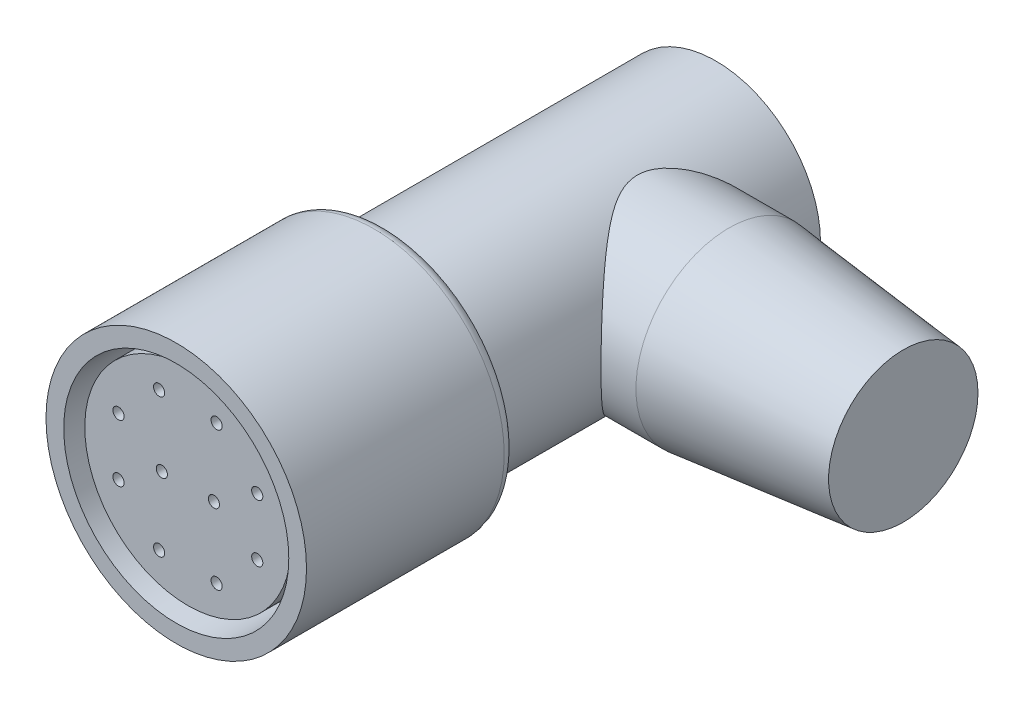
ISO-10303-21;
HEADER;
FILE_DESCRIPTION(('STEP AP214'),'2;1');
FILE_NAME('part.step','',(''),(''),'','','');
FILE_SCHEMA(('AUTOMOTIVE_DESIGN { 1 0 10303 214 1 1 1 1 }'));
ENDSEC;
DATA;
#1=APPLICATION_CONTEXT('core data for automotive mechanical design processes');
#2=APPLICATION_PROTOCOL_DEFINITION('international standard','automotive_design',2000,#1);
#3=PRODUCT_CONTEXT('',#1,'mechanical');
#4=PRODUCT('Part','Part','',(#3));
#5=PRODUCT_RELATED_PRODUCT_CATEGORY('part','',(#4));
#6=PRODUCT_DEFINITION_FORMATION('','',#4);
#7=PRODUCT_DEFINITION_CONTEXT('part definition',#1,'design');
#8=PRODUCT_DEFINITION('design','',#6,#7);
#9=PRODUCT_DEFINITION_SHAPE('','',#8);
#10=(LENGTH_UNIT() NAMED_UNIT(*) SI_UNIT(.MILLI.,.METRE.));
#11=(NAMED_UNIT(*) PLANE_ANGLE_UNIT() SI_UNIT($,.RADIAN.));
#12=(NAMED_UNIT(*) SI_UNIT($,.STERADIAN.) SOLID_ANGLE_UNIT());
#13=UNCERTAINTY_MEASURE_WITH_UNIT(LENGTH_MEASURE(1.E-05),#10,'distance_accuracy_value','');
#14=(GEOMETRIC_REPRESENTATION_CONTEXT(3) GLOBAL_UNCERTAINTY_ASSIGNED_CONTEXT((#13)) GLOBAL_UNIT_ASSIGNED_CONTEXT((#10,
#11,#12)) REPRESENTATION_CONTEXT('',''));
#15=CARTESIAN_POINT('',(0.,0.,0.));
#16=DIRECTION('',(0.,0.,1.));
#17=DIRECTION('',(1.,0.,0.));
#18=AXIS2_PLACEMENT_3D('',#15,#16,#17);
#19=CARTESIAN_POINT('',(0.,0.,-93.8655762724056));
#20=DIRECTION('',(0.,0.,1.));
#21=DIRECTION('',(1.,0.,0.));
#22=AXIS2_PLACEMENT_3D('',#19,#20,#21);
#23=CYLINDRICAL_SURFACE('',#22,7.14375);
#24=CARTESIAN_POINT('',(0.,0.,-15.08125));
#25=DIRECTION('',(0.,0.,-1.));
#26=DIRECTION('',(-1.,0.,0.));
#27=AXIS2_PLACEMENT_3D('',#24,#25,#26);
#28=CIRCLE('',#27,7.14375);
#29=CARTESIAN_POINT('',(-7.14375,0.,-15.08125));
#30=VERTEX_POINT('',#29);
#31=EDGE_CURVE('E193',#30,#30,#28,.T.);
#32=ORIENTED_EDGE('',*,*,#31,.T.);
#33=EDGE_LOOP('',(#32));
#34=FACE_BOUND('',#33,.T.);
#35=CARTESIAN_POINT('',(0.,0.,-36.83));
#36=DIRECTION('',(0.,0.,1.));
#37=DIRECTION('',(1.,0.,0.));
#38=AXIS2_PLACEMENT_3D('',#35,#36,#37);
#39=CIRCLE('',#38,7.14375);
#40=CARTESIAN_POINT('',(7.14375,0.,-36.83));
#41=VERTEX_POINT('',#40);
#42=EDGE_CURVE('E197',#41,#41,#39,.T.);
#43=ORIENTED_EDGE('',*,*,#42,.T.);
#44=EDGE_LOOP('',(#43));
#45=FACE_BOUND('',#44,.T.);
#46=CARTESIAN_POINT('',(7.14375,0.,-34.54863485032));
#47=CARTESIAN_POINT('',(7.14374857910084,0.14764724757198,-34.5486334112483));
#48=CARTESIAN_POINT('',(7.13916220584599,0.295324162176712,-34.5434749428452));
#49=CARTESIAN_POINT('',(7.12091507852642,0.589465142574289,-34.5229363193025));
#50=CARTESIAN_POINT('',(7.10724911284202,0.735928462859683,-34.5075502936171));
#51=CARTESIAN_POINT('',(7.07111667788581,1.02662644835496,-34.4668176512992));
#52=CARTESIAN_POINT('',(7.04863465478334,1.17085670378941,-34.4414534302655));
#53=CARTESIAN_POINT('',(6.99534274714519,1.45580562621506,-34.3812194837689));
#54=CARTESIAN_POINT('',(6.9645289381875,1.59652260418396,-34.3463452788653));
#55=CARTESIAN_POINT('',(6.89544524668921,1.87245030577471,-34.2679710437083));
#56=CARTESIAN_POINT('',(6.85723264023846,2.0076942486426,-34.2245372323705));
#57=CARTESIAN_POINT('',(6.77388478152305,2.27311106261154,-34.1295174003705));
#58=CARTESIAN_POINT('',(6.72874648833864,2.4032816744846,-34.077927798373));
#59=CARTESIAN_POINT('',(6.58404227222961,2.78523103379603,-33.911945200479));
#60=CARTESIAN_POINT('',(6.47511600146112,3.02872228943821,-33.7862584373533));
#61=CARTESIAN_POINT('',(6.27424404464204,3.42050554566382,-33.5519436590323));
#62=CARTESIAN_POINT('',(6.18715269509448,3.57528925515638,-33.4496848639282));
#63=CARTESIAN_POINT('',(6.00554421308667,3.87258281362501,-33.2344308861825));
#64=CARTESIAN_POINT('',(5.91102689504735,4.01509235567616,-33.1214354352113));
#65=CARTESIAN_POINT('',(5.71610146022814,4.28807226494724,-32.8855927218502));
#66=CARTESIAN_POINT('',(5.61567952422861,4.41851238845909,-32.7627220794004));
#67=CARTESIAN_POINT('',(5.41086774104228,4.66707574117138,-32.508221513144));
#68=CARTESIAN_POINT('',(5.30647842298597,4.78520060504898,-32.3765927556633));
#69=CARTESIAN_POINT('',(5.09307609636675,5.01183638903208,-32.1020185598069));
#70=CARTESIAN_POINT('',(4.98401190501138,5.12007059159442,-31.958884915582));
#71=CARTESIAN_POINT('',(4.76554475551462,5.32400912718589,-31.6641165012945));
#72=CARTESIAN_POINT('',(4.6561417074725,5.41970977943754,-31.5124792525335));
#73=CARTESIAN_POINT('',(4.439696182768,5.5983839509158,-31.2007710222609));
#74=CARTESIAN_POINT('',(4.33264970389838,5.68138074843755,-31.040716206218));
#75=CARTESIAN_POINT('',(4.1240503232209,5.8345595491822,-30.7112821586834));
#76=CARTESIAN_POINT('',(4.02249361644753,5.9047505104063,-30.5419095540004));
#77=CARTESIAN_POINT('',(3.82847892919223,6.03237172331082,-30.1906937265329));
#78=CARTESIAN_POINT('',(3.73612867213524,6.08965899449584,-30.0087374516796));
#79=CARTESIAN_POINT('',(3.56921705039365,6.18896389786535,-29.6328226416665));
#80=CARTESIAN_POINT('',(3.49462973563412,6.23100385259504,-29.4388821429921));
#81=CARTESIAN_POINT('',(3.38354736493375,6.29191266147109,-29.0720812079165));
#82=CARTESIAN_POINT('',(3.34280336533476,6.31345632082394,-28.901004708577));
#83=CARTESIAN_POINT('',(3.28748045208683,6.34245109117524,-28.5536240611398));
#84=CARTESIAN_POINT('',(3.27284459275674,6.34993287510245,-28.3773321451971));
#85=CARTESIAN_POINT('',(3.27258699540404,6.35006640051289,-28.0242544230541));
#86=CARTESIAN_POINT('',(3.28704310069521,6.34267835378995,-27.8474685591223));
#87=CARTESIAN_POINT('',(3.34218570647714,6.31378170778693,-27.4990779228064));
#88=CARTESIAN_POINT('',(3.3829283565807,6.29224287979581,-27.3274850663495));
#89=CARTESIAN_POINT('',(3.47189241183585,6.24347800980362,-27.0332776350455));
#90=CARTESIAN_POINT('',(3.51590708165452,6.21889608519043,-26.9088730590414));
#91=CARTESIAN_POINT('',(3.61254404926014,6.16326207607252,-26.6648953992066));
#92=CARTESIAN_POINT('',(3.66517172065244,6.13220594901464,-26.5453253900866));
#93=CARTESIAN_POINT('',(3.7768751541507,6.0640473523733,-26.3105596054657));
#94=CARTESIAN_POINT('',(3.83597147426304,6.02692540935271,-26.1953794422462));
#95=CARTESIAN_POINT('',(3.95866546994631,5.94705852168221,-25.9694313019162));
#96=CARTESIAN_POINT('',(4.02226475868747,5.90431155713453,-25.8586649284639));
#97=CARTESIAN_POINT('',(4.20096099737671,5.77963666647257,-25.5603436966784));
#98=CARTESIAN_POINT('',(4.31918306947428,5.69221139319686,-25.376940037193));
#99=CARTESIAN_POINT('',(4.55957629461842,5.50154974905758,-25.0211871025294));
#100=CARTESIAN_POINT('',(4.68175004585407,5.3983028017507,-24.8488453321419));
#101=CARTESIAN_POINT('',(4.92625797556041,5.17613988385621,-24.5148504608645));
#102=CARTESIAN_POINT('',(5.04859204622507,5.05723160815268,-24.35319216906));
#103=CARTESIAN_POINT('',(5.2904988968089,4.80359263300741,-24.0406941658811));
#104=CARTESIAN_POINT('',(5.41007286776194,4.66886891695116,-23.8898497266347));
#105=CARTESIAN_POINT('',(5.62164459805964,4.41050901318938,-23.627306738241));
#106=CARTESIAN_POINT('',(5.71455869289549,4.28964435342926,-23.513622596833));
#107=CARTESIAN_POINT('',(5.89555426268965,4.03729586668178,-23.2944830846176));
#108=CARTESIAN_POINT('',(5.98363457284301,3.90580949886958,-23.1890296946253));
#109=CARTESIAN_POINT('',(6.23822078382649,3.49583939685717,-22.8867040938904));
#110=CARTESIAN_POINT('',(6.39560964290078,3.20120746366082,-22.7032090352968));
#111=CARTESIAN_POINT('',(6.64437438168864,2.63803274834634,-22.4158140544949));
#112=CARTESIAN_POINT('',(6.74267214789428,2.37699095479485,-22.3032916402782));
#113=CARTESIAN_POINT('',(6.86828150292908,1.96980328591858,-22.160163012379));
#114=CARTESIAN_POINT('',(6.90651948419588,1.83142843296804,-22.1167206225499));
#115=CARTESIAN_POINT('',(6.97501883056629,1.55022061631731,-22.0390438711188));
#116=CARTESIAN_POINT('',(7.0052836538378,1.40738961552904,-22.0048055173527));
#117=CARTESIAN_POINT('',(7.05740067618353,1.11720277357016,-21.9459211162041));
#118=CARTESIAN_POINT('',(7.07919415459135,0.969822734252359,-21.9213420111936));
#119=CARTESIAN_POINT('',(7.11358590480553,0.672629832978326,-21.8825822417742));
#120=CARTESIAN_POINT('',(7.12618415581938,0.522816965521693,-21.8684016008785));
#121=CARTESIAN_POINT('',(7.14188277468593,0.222114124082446,-21.8507342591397));
#122=CARTESIAN_POINT('',(7.14498630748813,0.0712245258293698,-21.8472439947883));
#123=CARTESIAN_POINT('',(7.14162803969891,-0.230305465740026,-21.8510220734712));
#124=CARTESIAN_POINT('',(7.13516699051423,-0.380945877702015,-21.8582895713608));
#125=CARTESIAN_POINT('',(7.11400673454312,-0.664973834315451,-21.8821125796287));
#126=CARTESIAN_POINT('',(7.10023766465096,-0.798521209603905,-21.8976196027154));
#127=CARTESIAN_POINT('',(7.06541184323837,-1.06347510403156,-21.9368888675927));
#128=CARTESIAN_POINT('',(7.04435269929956,-1.19488090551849,-21.960653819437));
#129=CARTESIAN_POINT('',(6.99532570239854,-1.45466370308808,-22.0160718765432));
#130=CARTESIAN_POINT('',(6.96735968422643,-1.58304149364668,-22.0477228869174));
#131=CARTESIAN_POINT('',(6.90498050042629,-1.83614467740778,-22.1184730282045));
#132=CARTESIAN_POINT('',(6.87056489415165,-1.96086866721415,-22.1575749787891));
#133=CARTESIAN_POINT('',(6.75512930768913,-2.33940841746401,-22.2890713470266));
#134=CARTESIAN_POINT('',(6.66410296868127,-2.58623644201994,-22.3932063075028));
#135=CARTESIAN_POINT('',(6.46128824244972,-3.05794303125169,-22.6271904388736));
#136=CARTESIAN_POINT('',(6.34949268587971,-3.28281397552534,-22.7570484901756));
#137=CARTESIAN_POINT('',(6.13944447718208,-3.65711900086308,-23.0039047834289));
#138=CARTESIAN_POINT('',(6.04455997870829,-3.81155771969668,-23.116288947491));
#139=CARTESIAN_POINT('',(5.8477885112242,-4.10707244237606,-23.3519678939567));
#140=CARTESIAN_POINT('',(5.74590089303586,-4.24814720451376,-23.4752636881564));
#141=CARTESIAN_POINT('',(5.53670053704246,-4.51744242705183,-23.732096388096));
#142=CARTESIAN_POINT('',(5.42936999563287,-4.6456159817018,-23.8656677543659));
#143=CARTESIAN_POINT('',(5.21156801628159,-4.88869545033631,-24.1419115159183));
#144=CARTESIAN_POINT('',(5.1010972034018,-5.00360398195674,-24.2845821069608));
#145=CARTESIAN_POINT('',(4.87650656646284,-5.22283681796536,-24.582088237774));
#146=CARTESIAN_POINT('',(4.76236116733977,-5.32685786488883,-24.7371277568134));
#147=CARTESIAN_POINT('',(4.5354448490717,-5.52134288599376,-25.0566170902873));
#148=CARTESIAN_POINT('',(4.42267471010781,-5.61179946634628,-25.2210719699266));
#149=CARTESIAN_POINT('',(4.20233946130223,-5.77862577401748,-25.5594181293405));
#150=CARTESIAN_POINT('',(4.09475807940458,-5.85504198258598,-25.7332757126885));
#151=CARTESIAN_POINT('',(3.88934379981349,-5.99345047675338,-26.091989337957));
#152=CARTESIAN_POINT('',(3.791498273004,-6.0554615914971,-26.2768306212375));
#153=CARTESIAN_POINT('',(3.62231510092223,-6.15797978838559,-26.6387305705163));
#154=CARTESIAN_POINT('',(3.54926346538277,-6.20007471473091,-26.8145177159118));
#155=CARTESIAN_POINT('',(3.42453971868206,-6.26983807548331,-27.1762449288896));
#156=CARTESIAN_POINT('',(3.37281319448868,-6.29754327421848,-27.3621577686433));
#157=CARTESIAN_POINT('',(3.31734699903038,-6.326832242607,-27.6480806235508));
#158=CARTESIAN_POINT('',(3.30251877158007,-6.33456138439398,-27.7453571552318));
#159=CARTESIAN_POINT('',(3.28139404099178,-6.34553121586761,-27.9411019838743));
#160=CARTESIAN_POINT('',(3.27509633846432,-6.34877253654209,-28.0395701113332));
#161=CARTESIAN_POINT('',(3.27145256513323,-6.35065082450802,-28.2366777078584));
#162=CARTESIAN_POINT('',(3.27410300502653,-6.34928958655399,-28.3353170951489));
#163=CARTESIAN_POINT('',(3.28816881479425,-6.34201628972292,-28.5317984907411));
#164=CARTESIAN_POINT('',(3.29958535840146,-6.33610362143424,-28.6296403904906));
#165=CARTESIAN_POINT('',(3.3315838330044,-6.31933996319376,-28.8305477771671));
#166=CARTESIAN_POINT('',(3.35275895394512,-6.30816815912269,-28.9334909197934));
#167=CARTESIAN_POINT('',(3.40310334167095,-6.28115195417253,-29.1368057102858));
#168=CARTESIAN_POINT('',(3.43227854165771,-6.26530408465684,-29.2371753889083));
#169=CARTESIAN_POINT('',(3.52984092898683,-6.21118913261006,-29.5344021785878));
#170=CARTESIAN_POINT('',(3.60816395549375,-6.16639968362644,-29.7268287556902));
#171=CARTESIAN_POINT('',(3.77149556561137,-6.06770833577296,-30.0788192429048));
#172=CARTESIAN_POINT('',(3.85480506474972,-6.01536341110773,-30.239663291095));
#173=CARTESIAN_POINT('',(4.02948214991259,-5.89978121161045,-30.5529822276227));
#174=CARTESIAN_POINT('',(4.12085617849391,-5.83653518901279,-30.7054502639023));
#175=CARTESIAN_POINT('',(4.30828121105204,-5.69959497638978,-31.0029116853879));
#176=CARTESIAN_POINT('',(4.40433880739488,-5.62588576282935,-31.1478939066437));
#177=CARTESIAN_POINT('',(4.59851456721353,-5.46831485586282,-31.4306954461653));
#178=CARTESIAN_POINT('',(4.69663213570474,-5.38445606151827,-31.5685167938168));
#179=CARTESIAN_POINT('',(4.90291003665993,-5.19768088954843,-31.8507638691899));
#180=CARTESIAN_POINT('',(5.01109213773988,-5.09369702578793,-31.9944689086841));
#181=CARTESIAN_POINT('',(5.22565671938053,-4.87333006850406,-32.2735295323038));
#182=CARTESIAN_POINT('',(5.33203888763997,-4.75694484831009,-32.4088836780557));
#183=CARTESIAN_POINT('',(5.54098998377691,-4.51181448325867,-32.6705574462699));
#184=CARTESIAN_POINT('',(5.64356517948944,-4.38309102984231,-32.7968922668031));
#185=CARTESIAN_POINT('',(5.84332162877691,-4.11303089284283,-33.039970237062));
#186=CARTESIAN_POINT('',(5.9405019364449,-3.97169200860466,-33.1567117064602));
#187=CARTESIAN_POINT('',(6.18526042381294,-3.58541838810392,-33.4480487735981));
#188=CARTESIAN_POINT('',(6.32716492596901,-3.33014110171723,-33.6141788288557));
#189=CARTESIAN_POINT('',(6.51974188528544,-2.92381261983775,-33.8375853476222));
#190=CARTESIAN_POINT('',(6.58056207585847,-2.78444433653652,-33.9077649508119));
#191=CARTESIAN_POINT('',(6.69444521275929,-2.49824794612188,-34.0386675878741));
#192=CARTESIAN_POINT('',(6.74750963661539,-2.35142126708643,-34.099392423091));
#193=CARTESIAN_POINT('',(6.8373245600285,-2.07413172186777,-34.2018716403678));
#194=CARTESIAN_POINT('',(6.87532893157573,-1.94461956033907,-34.2451072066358));
#195=CARTESIAN_POINT('',(6.9443951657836,-1.68138128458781,-34.3235271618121));
#196=CARTESIAN_POINT('',(6.97545835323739,-1.54765598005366,-34.358713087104));
#197=CARTESIAN_POINT('',(7.03003591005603,-1.27701865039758,-34.4204471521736));
#198=CARTESIAN_POINT('',(7.05356609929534,-1.14011395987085,-34.4470133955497));
#199=CARTESIAN_POINT('',(7.09270536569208,-0.863797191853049,-34.4911629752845));
#200=CARTESIAN_POINT('',(7.10831842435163,-0.72438641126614,-34.5087508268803));
#201=CARTESIAN_POINT('',(7.1277704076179,-0.487351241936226,-34.5306537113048));
#202=CARTESIAN_POINT('',(7.1337563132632,-0.39011602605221,-34.5373902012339));
#203=CARTESIAN_POINT('',(7.14174694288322,-0.195258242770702,-34.5463816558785));
#204=CARTESIAN_POINT('',(7.14375093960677,-0.097635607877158,-34.5486358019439));
#205=CARTESIAN_POINT('',(7.14375,0.,-34.54863485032));
#206=B_SPLINE_CURVE_WITH_KNOTS('',3,(#46,#47,#48,#49,#50,#51,#52,#53,#54,#55,#56,#57,#58,#59,
#60,#61,#62,#63,#64,#65,#66,#67,#68,#69,#70,#71,#72,#73,#74,#75,#76,#77,#78,#79,#80,#81,#82,#83,
#84,#85,#86,#87,#88,#89,#90,#91,#92,#93,#94,#95,#96,#97,#98,#99,#100,#101,#102,#103,#104,#105,
#106,#107,#108,#109,#110,#111,#112,#113,#114,#115,#116,#117,#118,#119,#120,#121,#122,#123,#124,
#125,#126,#127,#128,#129,#130,#131,#132,#133,#134,#135,#136,#137,#138,#139,#140,#141,#142,#143,
#144,#145,#146,#147,#148,#149,#150,#151,#152,#153,#154,#155,#156,#157,#158,#159,#160,#161,#162,
#163,#164,#165,#166,#167,#168,#169,#170,#171,#172,#173,#174,#175,#176,#177,#178,#179,#180,#181,
#182,#183,#184,#185,#186,#187,#188,#189,#190,#191,#192,#193,#194,#195,#196,#197,#198,#199,#200,
#201,#202,#203,#204,#205),.UNSPECIFIED.,.T.,.F.,(4,2,2,2,2,2,2,2,2,2,2,2,2,2,2,2,2,2,2,2,2,2,2,
2,2,2,2,2,2,2,2,2,2,2,2,2,2,2,2,2,2,2,2,2,2,2,2,2,2,2,2,2,2,2,2,2,2,2,2,2,2,2,2,2,2,2,2,2,2,2,2,
2,2,2,2,2,2,2,2,4),(0.,0.442833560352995,0.885921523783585,1.32979475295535,1.77387741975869,
2.21465065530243,2.6556179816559,3.53667695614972,4.15079228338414,4.76492296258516,
5.38055306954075,5.99610135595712,6.62552433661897,7.25513174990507,7.88357130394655,
8.51156954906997,9.14621709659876,9.77993171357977,10.3093479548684,10.8376080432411,
11.3672835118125,11.8980941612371,12.3002375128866,12.7026327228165,13.1063461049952,
13.5102048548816,14.2143906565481,14.919049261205,15.6233629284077,16.3273667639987,
16.8973533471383,17.467476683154,18.6045711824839,19.5030337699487,19.9525201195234,
20.4018111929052,20.8541633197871,21.3065164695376,21.758718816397,22.2108856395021,
22.6158626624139,23.0209727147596,23.4259752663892,23.8311313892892,24.6765224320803,
25.5222058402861,26.1611972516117,26.8002479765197,27.4415440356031,28.0827133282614,
28.7385904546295,29.3948238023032,30.0488438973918,30.7020042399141,31.2855233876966,
31.867544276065,32.163241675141,32.4588974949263,32.7544380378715,33.0500181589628,
33.3665843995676,33.6833860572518,34.3186471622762,34.8836064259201,35.44902117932,
36.0152561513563,36.5813297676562,37.204089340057,37.8269558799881,38.4487467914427,
39.0706463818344,40.0742243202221,40.5761685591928,41.0780170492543,41.5027796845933,
41.9274611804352,42.3512448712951,42.7748152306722,43.06759704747,43.3604323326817),.UNSPECIFIED.);
#207=CARTESIAN_POINT('',(7.14375,0.,-34.54863485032));
#208=VERTEX_POINT('',#207);
#209=EDGE_CURVE('E151',#208,#208,#206,.T.);
#210=ORIENTED_EDGE('',*,*,#209,.F.);
#211=EDGE_LOOP('',(#210));
#212=FACE_BOUND('',#211,.T.);
#213=ADVANCED_FACE('F52',(#34,#45,#212),#23,.T.);
#214=CARTESIAN_POINT('',(0.,0.,-12.7));
#215=DIRECTION('',(0.,0.,1.));
#216=DIRECTION('',(1.,0.,0.));
#217=AXIS2_PLACEMENT_3D('',#214,#215,#216);
#218=PLANE('',#217);
#219=CARTESIAN_POINT('',(0.,0.,-12.7));
#220=DIRECTION('',(0.,0.,-1.));
#221=DIRECTION('',(-1.,0.,0.));
#222=AXIS2_PLACEMENT_3D('',#219,#220,#221);
#223=CIRCLE('',#222,6.78482472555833);
#224=CARTESIAN_POINT('',(-6.78482472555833,0.,-12.7));
#225=VERTEX_POINT('',#224);
#226=EDGE_CURVE('E131',#225,#225,#223,.T.);
#227=ORIENTED_EDGE('',*,*,#226,.T.);
#228=EDGE_LOOP('',(#227));
#229=FACE_BOUND('',#228,.T.);
#230=CARTESIAN_POINT('',(0.,0.,-12.7));
#231=DIRECTION('',(0.,0.,1.));
#232=DIRECTION('',(1.,0.,0.));
#233=AXIS2_PLACEMENT_3D('',#230,#231,#232);
#234=CIRCLE('',#233,6.14982472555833);
#235=CARTESIAN_POINT('',(6.14982472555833,0.,-12.7));
#236=VERTEX_POINT('',#235);
#237=EDGE_CURVE('E148',#236,#236,#234,.F.);
#238=ORIENTED_EDGE('',*,*,#237,.F.);
#239=EDGE_LOOP('',(#238));
#240=FACE_BOUND('',#239,.T.);
#241=ADVANCED_FACE('F183',(#229,#240),#218,.F.);
#242=CARTESIAN_POINT('',(0.,0.,-12.7));
#243=DIRECTION('',(0.,0.,1.));
#244=DIRECTION('',(1.,0.,0.));
#245=AXIS2_PLACEMENT_3D('',#242,#243,#244);
#246=CYLINDRICAL_SURFACE('',#245,8.89);
#247=CARTESIAN_POINT('',(0.,0.,-13.49375));
#248=DIRECTION('',(0.,0.,-1.));
#249=DIRECTION('',(-1.,0.,0.));
#250=AXIS2_PLACEMENT_3D('',#247,#248,#249);
#251=CIRCLE('',#250,8.89);
#252=CARTESIAN_POINT('',(-8.89,0.,-13.49375));
#253=VERTEX_POINT('',#252);
#254=EDGE_CURVE('E14',#253,#253,#251,.F.);
#255=ORIENTED_EDGE('',*,*,#254,.T.);
#256=EDGE_LOOP('',(#255));
#257=FACE_BOUND('',#256,.T.);
#258=CARTESIAN_POINT('',(0.,0.,0.));
#259=DIRECTION('',(0.,0.,1.));
#260=DIRECTION('',(1.,0.,0.));
#261=AXIS2_PLACEMENT_3D('',#258,#259,#260);
#262=CIRCLE('',#261,8.89);
#263=CARTESIAN_POINT('',(8.89,0.,0.));
#264=VERTEX_POINT('',#263);
#265=EDGE_CURVE('E143',#264,#264,#262,.T.);
#266=ORIENTED_EDGE('',*,*,#265,.F.);
#267=EDGE_LOOP('',(#266));
#268=FACE_BOUND('',#267,.T.);
#269=ADVANCED_FACE('F188',(#257,#268),#246,.T.);
#270=CARTESIAN_POINT('',(0.,0.,0.));
#271=DIRECTION('',(0.,0.,1.));
#272=DIRECTION('',(1.,0.,0.));
#273=AXIS2_PLACEMENT_3D('',#270,#271,#272);
#274=PLANE('',#273);
#275=CARTESIAN_POINT('',(0.,0.,0.));
#276=DIRECTION('',(0.,0.,1.));
#277=DIRECTION('',(1.,0.,0.));
#278=AXIS2_PLACEMENT_3D('',#275,#276,#277);
#279=CIRCLE('',#278,7.68114591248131);
#280=CARTESIAN_POINT('',(7.68114591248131,0.,0.));
#281=VERTEX_POINT('',#280);
#282=EDGE_CURVE('E137',#281,#281,#279,.T.);
#283=ORIENTED_EDGE('',*,*,#282,.F.);
#284=EDGE_LOOP('',(#283));
#285=FACE_BOUND('',#284,.T.);
#286=ORIENTED_EDGE('',*,*,#265,.T.);
#287=EDGE_LOOP('',(#286));
#288=FACE_BOUND('',#287,.T.);
#289=ADVANCED_FACE('F299',(#285,#288),#274,.T.);
#290=CARTESIAN_POINT('',(0.,0.,-12.7));
#291=DIRECTION('',(0.,0.,1.));
#292=DIRECTION('',(1.,0.,0.));
#293=AXIS2_PLACEMENT_3D('',#290,#291,#292);
#294=CYLINDRICAL_SURFACE('',#293,7.68114591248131);
#295=CARTESIAN_POINT('',(0.,0.,-12.7));
#296=DIRECTION('',(0.,0.,1.));
#297=DIRECTION('',(1.,0.,0.));
#298=AXIS2_PLACEMENT_3D('',#295,#296,#297);
#299=CIRCLE('',#298,7.68114591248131);
#300=CARTESIAN_POINT('',(7.68114591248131,0.,-12.7));
#301=VERTEX_POINT('',#300);
#302=EDGE_CURVE('E140',#301,#301,#299,.T.);
#303=ORIENTED_EDGE('',*,*,#302,.F.);
#304=EDGE_LOOP('',(#303));
#305=FACE_BOUND('',#304,.T.);
#306=ORIENTED_EDGE('',*,*,#282,.T.);
#307=EDGE_LOOP('',(#306));
#308=FACE_BOUND('',#307,.T.);
#309=ADVANCED_FACE('F296',(#305,#308),#294,.F.);
#310=CARTESIAN_POINT('',(0.,0.,-12.7));
#311=DIRECTION('',(0.,0.,-1.));
#312=DIRECTION('',(-1.,0.,0.));
#313=AXIS2_PLACEMENT_3D('',#310,#311,#312);
#314=PLANE('',#313);
#315=CARTESIAN_POINT('',(0.,0.,-12.7));
#316=DIRECTION('',(0.,0.,1.));
#317=DIRECTION('',(1.,0.,0.));
#318=AXIS2_PLACEMENT_3D('',#315,#316,#317);
#319=CIRCLE('',#318,7.03686990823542);
#320=CARTESIAN_POINT('',(-0.317500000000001,7.02970353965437,-12.7));
#321=VERTEX_POINT('',#320);
#322=CARTESIAN_POINT('',(0.3175,7.02970353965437,-12.7));
#323=VERTEX_POINT('',#322);
#324=EDGE_CURVE('E109',#321,#323,#319,.T.);
#325=ORIENTED_EDGE('',*,*,#324,.F.);
#326=DIRECTION('',(0.,-1.,0.));
#327=VECTOR('',#326,1.);
#328=CARTESIAN_POINT('',(-0.3175,7.43655036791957,-12.7));
#329=LINE('',#328,#327);
#330=CARTESIAN_POINT('',(-0.3175,7.43655036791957,-12.7));
#331=VERTEX_POINT('',#330);
#332=EDGE_CURVE('E67',#331,#321,#329,.T.);
#333=ORIENTED_EDGE('',*,*,#332,.F.);
#334=DIRECTION('',(-1.,0.,0.));
#335=VECTOR('',#334,1.);
#336=CARTESIAN_POINT('',(-0.3175,7.43655036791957,-12.7));
#337=LINE('',#336,#335);
#338=CARTESIAN_POINT('',(0.3175,7.43655036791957,-12.7));
#339=VERTEX_POINT('',#338);
#340=EDGE_CURVE('E115',#339,#331,#337,.T.);
#341=ORIENTED_EDGE('',*,*,#340,.F.);
#342=DIRECTION('',(0.,1.,0.));
#343=VECTOR('',#342,1.);
#344=CARTESIAN_POINT('',(0.3175,7.43655036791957,-12.7));
#345=LINE('',#344,#343);
#346=EDGE_CURVE('E98',#323,#339,#345,.T.);
#347=ORIENTED_EDGE('',*,*,#346,.F.);
#348=EDGE_LOOP('',(#325,#333,#341,#347));
#349=FACE_BOUND('',#348,.T.);
#350=ORIENTED_EDGE('',*,*,#302,.T.);
#351=EDGE_LOOP('',(#350));
#352=FACE_BOUND('',#351,.T.);
#353=ADVANCED_FACE('F113',(#349,#352),#314,.F.);
#354=CARTESIAN_POINT('',(0.,0.,-14.2875));
#355=DIRECTION('',(0.,0.,-1.));
#356=DIRECTION('',(-1.,0.,0.));
#357=AXIS2_PLACEMENT_3D('',#354,#355,#356);
#358=PLANE('',#357);
#359=CARTESIAN_POINT('',(0.,0.,-14.2875));
#360=DIRECTION('',(0.,0.,-1.));
#361=DIRECTION('',(-1.,0.,0.));
#362=AXIS2_PLACEMENT_3D('',#359,#360,#361);
#363=CIRCLE('',#362,8.09625);
#364=CARTESIAN_POINT('',(-8.09625,0.,-14.2875));
#365=VERTEX_POINT('',#364);
#366=EDGE_CURVE('E60',#365,#365,#363,.T.);
#367=ORIENTED_EDGE('',*,*,#366,.T.);
#368=EDGE_LOOP('',(#367));
#369=FACE_BOUND('',#368,.T.);
#370=CARTESIAN_POINT('',(0.,0.,-14.2875));
#371=DIRECTION('',(0.,0.,-1.));
#372=DIRECTION('',(-1.,0.,0.));
#373=AXIS2_PLACEMENT_3D('',#370,#371,#372);
#374=CIRCLE('',#373,6.78482472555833);
#375=CARTESIAN_POINT('',(-6.78482472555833,0.,-14.2875));
#376=VERTEX_POINT('',#375);
#377=EDGE_CURVE('E134',#376,#376,#374,.T.);
#378=ORIENTED_EDGE('',*,*,#377,.F.);
#379=EDGE_LOOP('',(#378));
#380=FACE_BOUND('',#379,.T.);
#381=ADVANCED_FACE('F285',(#369,#380),#358,.T.);
#382=CARTESIAN_POINT('',(0.,0.,-14.2875));
#383=DIRECTION('',(0.,0.,1.));
#384=DIRECTION('',(1.,0.,0.));
#385=AXIS2_PLACEMENT_3D('',#382,#383,#384);
#386=CYLINDRICAL_SURFACE('',#385,6.78482472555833);
#387=ORIENTED_EDGE('',*,*,#377,.T.);
#388=EDGE_LOOP('',(#387));
#389=FACE_BOUND('',#388,.T.);
#390=ORIENTED_EDGE('',*,*,#226,.F.);
#391=EDGE_LOOP('',(#390));
#392=FACE_BOUND('',#391,.T.);
#393=ADVANCED_FACE('F278',(#389,#392),#386,.F.);
#394=CARTESIAN_POINT('',(-0.3175,7.43655036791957,-12.7));
#395=DIRECTION('',(-1.,0.,0.));
#396=DIRECTION('',(0.,-1.,0.));
#397=AXIS2_PLACEMENT_3D('',#394,#395,#396);
#398=PLANE('',#397);
#399=DIRECTION('',(0.,-1.,0.));
#400=VECTOR('',#399,1.);
#401=CARTESIAN_POINT('',(-0.3175,7.43655036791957,-0.79375));
#402=LINE('',#401,#400);
#403=CARTESIAN_POINT('',(-0.3175,7.43655036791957,-0.79375));
#404=VERTEX_POINT('',#403);
#405=CARTESIAN_POINT('',(-0.317500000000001,7.02970353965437,-0.79375));
#406=VERTEX_POINT('',#405);
#407=EDGE_CURVE('E120',#404,#406,#402,.T.);
#408=ORIENTED_EDGE('',*,*,#407,.F.);
#409=DIRECTION('',(0.,0.,1.));
#410=VECTOR('',#409,1.);
#411=CARTESIAN_POINT('',(-0.3175,7.43655036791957,-12.7));
#412=LINE('',#411,#410);
#413=EDGE_CURVE('E73',#331,#404,#412,.T.);
#414=ORIENTED_EDGE('',*,*,#413,.F.);
#415=ORIENTED_EDGE('',*,*,#332,.T.);
#416=DIRECTION('',(0.,0.,1.));
#417=VECTOR('',#416,1.);
#418=CARTESIAN_POINT('',(-0.317500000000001,7.02970353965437,-12.7));
#419=LINE('',#418,#417);
#420=EDGE_CURVE('E106',#321,#406,#419,.T.);
#421=ORIENTED_EDGE('',*,*,#420,.T.);
#422=EDGE_LOOP('',(#408,#414,#415,#421));
#423=FACE_BOUND('',#422,.T.);
#424=ADVANCED_FACE('F275',(#423),#398,.T.);
#425=CARTESIAN_POINT('',(-0.3175,7.43655036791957,-12.7));
#426=DIRECTION('',(0.,1.,0.));
#427=DIRECTION('',(0.,0.,1.));
#428=AXIS2_PLACEMENT_3D('',#425,#426,#427);
#429=PLANE('',#428);
#430=DIRECTION('',(-1.,0.,0.));
#431=VECTOR('',#430,1.);
#432=CARTESIAN_POINT('',(-0.3175,7.43655036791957,-0.79375));
#433=LINE('',#432,#431);
#434=CARTESIAN_POINT('',(0.3175,7.43655036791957,-0.79375));
#435=VERTEX_POINT('',#434);
#436=EDGE_CURVE('E127',#435,#404,#433,.T.);
#437=ORIENTED_EDGE('',*,*,#436,.F.);
#438=DIRECTION('',(0.,0.,1.));
#439=VECTOR('',#438,1.);
#440=CARTESIAN_POINT('',(0.3175,7.43655036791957,-12.7));
#441=LINE('',#440,#439);
#442=EDGE_CURVE('E105',#339,#435,#441,.T.);
#443=ORIENTED_EDGE('',*,*,#442,.F.);
#444=ORIENTED_EDGE('',*,*,#340,.T.);
#445=ORIENTED_EDGE('',*,*,#413,.T.);
#446=EDGE_LOOP('',(#437,#443,#444,#445));
#447=FACE_BOUND('',#446,.T.);
#448=ADVANCED_FACE('F277',(#447),#429,.T.);
#449=CARTESIAN_POINT('',(0.3175,7.43655036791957,-12.7));
#450=DIRECTION('',(1.,0.,0.));
#451=DIRECTION('',(0.,1.,0.));
#452=AXIS2_PLACEMENT_3D('',#449,#450,#451);
#453=PLANE('',#452);
#454=DIRECTION('',(0.,1.,0.));
#455=VECTOR('',#454,1.);
#456=CARTESIAN_POINT('',(0.3175,7.43655036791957,-0.79375));
#457=LINE('',#456,#455);
#458=CARTESIAN_POINT('',(0.3175,7.02970353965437,-0.79375));
#459=VERTEX_POINT('',#458);
#460=EDGE_CURVE('E101',#459,#435,#457,.T.);
#461=ORIENTED_EDGE('',*,*,#460,.F.);
#462=DIRECTION('',(0.,0.,1.));
#463=VECTOR('',#462,1.);
#464=CARTESIAN_POINT('',(0.3175,7.02970353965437,-12.7));
#465=LINE('',#464,#463);
#466=EDGE_CURVE('E94',#323,#459,#465,.T.);
#467=ORIENTED_EDGE('',*,*,#466,.F.);
#468=ORIENTED_EDGE('',*,*,#346,.T.);
#469=ORIENTED_EDGE('',*,*,#442,.T.);
#470=EDGE_LOOP('',(#461,#467,#468,#469));
#471=FACE_BOUND('',#470,.T.);
#472=ADVANCED_FACE('F96',(#471),#453,.T.);
#473=CARTESIAN_POINT('',(0.,0.,-12.7));
#474=DIRECTION('',(0.,0.,1.));
#475=DIRECTION('',(1.,0.,0.));
#476=AXIS2_PLACEMENT_3D('',#473,#474,#475);
#477=CYLINDRICAL_SURFACE('',#476,7.03686990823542);
#478=CARTESIAN_POINT('',(0.,0.,-0.79375));
#479=DIRECTION('',(0.,0.,1.));
#480=DIRECTION('',(1.,0.,0.));
#481=AXIS2_PLACEMENT_3D('',#478,#479,#480);
#482=CIRCLE('',#481,7.03686990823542);
#483=EDGE_CURVE('E123',#406,#459,#482,.T.);
#484=ORIENTED_EDGE('',*,*,#483,.F.);
#485=ORIENTED_EDGE('',*,*,#420,.F.);
#486=ORIENTED_EDGE('',*,*,#324,.T.);
#487=ORIENTED_EDGE('',*,*,#466,.T.);
#488=EDGE_LOOP('',(#484,#485,#486,#487));
#489=FACE_BOUND('',#488,.T.);
#490=ADVANCED_FACE('F110',(#489),#477,.T.);
#491=CARTESIAN_POINT('',(0.,0.,-0.79375));
#492=DIRECTION('',(0.,0.,1.));
#493=DIRECTION('',(1.,0.,0.));
#494=AXIS2_PLACEMENT_3D('',#491,#492,#493);
#495=PLANE('',#494);
#496=CARTESIAN_POINT('',(1.778,0.,-0.79375));
#497=DIRECTION('',(0.,0.,1.));
#498=DIRECTION('',(1.,0.,0.));
#499=AXIS2_PLACEMENT_3D('',#496,#497,#498);
#500=CIRCLE('',#499,0.381);
#501=CARTESIAN_POINT('',(2.159,0.,-0.79375));
#502=VERTEX_POINT('',#501);
#503=EDGE_CURVE('E203',#502,#502,#500,.T.);
#504=ORIENTED_EDGE('',*,*,#503,.F.);
#505=EDGE_LOOP('',(#504));
#506=FACE_BOUND('',#505,.T.);
#507=CARTESIAN_POINT('',(-1.778,0.,-0.79375));
#508=DIRECTION('',(0.,0.,1.));
#509=DIRECTION('',(1.,0.,0.));
#510=AXIS2_PLACEMENT_3D('',#507,#508,#509);
#511=CIRCLE('',#510,0.381000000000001);
#512=CARTESIAN_POINT('',(-1.397,0.,-0.79375));
#513=VERTEX_POINT('',#512);
#514=EDGE_CURVE('E212',#513,#513,#511,.T.);
#515=ORIENTED_EDGE('',*,*,#514,.F.);
#516=EDGE_LOOP('',(#515));
#517=FACE_BOUND('',#516,.T.);
#518=CARTESIAN_POINT('',(4.73484351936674,-1.96123640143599,-0.79375));
#519=DIRECTION('',(0.,0.,1.));
#520=DIRECTION('',(0.707106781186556,-0.707106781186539,0.));
#521=AXIS2_PLACEMENT_3D('',#518,#519,#520);
#522=CIRCLE('',#521,0.381000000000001);
#523=CARTESIAN_POINT('',(5.00425120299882,-2.23064408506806,-0.79375));
#524=VERTEX_POINT('',#523);
#525=EDGE_CURVE('E218',#524,#524,#522,.T.);
#526=ORIENTED_EDGE('',*,*,#525,.F.);
#527=EDGE_LOOP('',(#526));
#528=FACE_BOUND('',#527,.T.);
#529=CARTESIAN_POINT('',(1.9612364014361,-4.73484351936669,-0.79375));
#530=DIRECTION('',(0.,0.,1.));
#531=DIRECTION('',(0.,-1.,0.));
#532=AXIS2_PLACEMENT_3D('',#529,#530,#531);
#533=CIRCLE('',#532,0.381000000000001);
#534=CARTESIAN_POINT('',(1.96123640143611,-5.11584351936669,-0.79375));
#535=VERTEX_POINT('',#534);
#536=EDGE_CURVE('E224',#535,#535,#533,.T.);
#537=ORIENTED_EDGE('',*,*,#536,.F.);
#538=EDGE_LOOP('',(#537));
#539=FACE_BOUND('',#538,.T.);
#540=CARTESIAN_POINT('',(-1.96123640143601,-4.73484351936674,-0.79375));
#541=DIRECTION('',(0.,0.,1.));
#542=DIRECTION('',(-0.707106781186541,-0.707106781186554,0.));
#543=AXIS2_PLACEMENT_3D('',#540,#541,#542);
#544=CIRCLE('',#543,0.381000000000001);
#545=CARTESIAN_POINT('',(-2.23064408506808,-5.00425120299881,-0.79375));
#546=VERTEX_POINT('',#545);
#547=EDGE_CURVE('E230',#546,#546,#544,.T.);
#548=ORIENTED_EDGE('',*,*,#547,.F.);
#549=EDGE_LOOP('',(#548));
#550=FACE_BOUND('',#549,.T.);
#551=CARTESIAN_POINT('',(-4.73484351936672,-1.96123640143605,-0.79375));
#552=DIRECTION('',(0.,0.,1.));
#553=DIRECTION('',(-1.,0.,0.));
#554=AXIS2_PLACEMENT_3D('',#551,#552,#553);
#555=CIRCLE('',#554,0.381000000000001);
#556=CARTESIAN_POINT('',(-5.11584351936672,-1.96123640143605,-0.79375));
#557=VERTEX_POINT('',#556);
#558=EDGE_CURVE('E236',#557,#557,#555,.T.);
#559=ORIENTED_EDGE('',*,*,#558,.F.);
#560=EDGE_LOOP('',(#559));
#561=FACE_BOUND('',#560,.T.);
#562=CARTESIAN_POINT('',(-4.73484351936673,1.96123640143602,-0.79375));
#563=DIRECTION('',(0.,0.,1.));
#564=DIRECTION('',(-0.707106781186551,0.707106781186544,0.));
#565=AXIS2_PLACEMENT_3D('',#562,#563,#564);
#566=CIRCLE('',#565,0.381000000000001);
#567=CARTESIAN_POINT('',(-5.0042512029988,2.2306440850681,-0.79375));
#568=VERTEX_POINT('',#567);
#569=EDGE_CURVE('E242',#568,#568,#566,.T.);
#570=ORIENTED_EDGE('',*,*,#569,.F.);
#571=EDGE_LOOP('',(#570));
#572=FACE_BOUND('',#571,.T.);
#573=CARTESIAN_POINT('',(-1.96123640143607,4.73484351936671,-0.79375));
#574=DIRECTION('',(0.,0.,1.));
#575=DIRECTION('',(0.,1.,0.));
#576=AXIS2_PLACEMENT_3D('',#573,#574,#575);
#577=CIRCLE('',#576,0.381000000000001);
#578=CARTESIAN_POINT('',(-1.96123640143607,5.11584351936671,-0.79375));
#579=VERTEX_POINT('',#578);
#580=EDGE_CURVE('E248',#579,#579,#577,.T.);
#581=ORIENTED_EDGE('',*,*,#580,.F.);
#582=EDGE_LOOP('',(#581));
#583=FACE_BOUND('',#582,.T.);
#584=CARTESIAN_POINT('',(1.96123640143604,4.73484351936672,-0.79375));
#585=DIRECTION('',(0.,0.,1.));
#586=DIRECTION('',(0.707106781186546,0.707106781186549,0.));
#587=AXIS2_PLACEMENT_3D('',#584,#585,#586);
#588=CIRCLE('',#587,0.381000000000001);
#589=CARTESIAN_POINT('',(2.23064408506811,5.0042512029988,-0.79375));
#590=VERTEX_POINT('',#589);
#591=EDGE_CURVE('E254',#590,#590,#588,.T.);
#592=ORIENTED_EDGE('',*,*,#591,.F.);
#593=EDGE_LOOP('',(#592));
#594=FACE_BOUND('',#593,.T.);
#595=CARTESIAN_POINT('',(4.73484351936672,1.96123640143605,-0.79375));
#596=DIRECTION('',(0.,0.,1.));
#597=DIRECTION('',(1.,0.,0.));
#598=AXIS2_PLACEMENT_3D('',#595,#596,#597);
#599=CIRCLE('',#598,0.381000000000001);
#600=CARTESIAN_POINT('',(5.11584351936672,1.96123640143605,-0.79375));
#601=VERTEX_POINT('',#600);
#602=EDGE_CURVE('E260',#601,#601,#599,.T.);
#603=ORIENTED_EDGE('',*,*,#602,.F.);
#604=EDGE_LOOP('',(#603));
#605=FACE_BOUND('',#604,.T.);
#606=ORIENTED_EDGE('',*,*,#407,.T.);
#607=ORIENTED_EDGE('',*,*,#483,.T.);
#608=ORIENTED_EDGE('',*,*,#460,.T.);
#609=ORIENTED_EDGE('',*,*,#436,.T.);
#610=EDGE_LOOP('',(#606,#607,#608,#609));
#611=FACE_BOUND('',#610,.T.);
#612=ADVANCED_FACE('F270',(#506,#517,#528,#539,#550,#561,#572,#583,#594,#605,#611),#495,.T.);
#613=CARTESIAN_POINT('',(4.73484351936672,1.96123640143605,-11.1125));
#614=DIRECTION('',(0.,0.,1.));
#615=DIRECTION('',(1.,0.,0.));
#616=AXIS2_PLACEMENT_3D('',#613,#614,#615);
#617=CYLINDRICAL_SURFACE('',#616,0.381000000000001);
#618=CARTESIAN_POINT('',(4.73484351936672,1.96123640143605,-11.1125));
#619=DIRECTION('',(0.,0.,1.));
#620=DIRECTION('',(1.,0.,0.));
#621=AXIS2_PLACEMENT_3D('',#618,#619,#620);
#622=CIRCLE('',#621,0.381000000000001);
#623=CARTESIAN_POINT('',(5.11584351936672,1.96123640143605,-11.1125));
#624=VERTEX_POINT('',#623);
#625=EDGE_CURVE('E124',#624,#624,#622,.T.);
#626=ORIENTED_EDGE('',*,*,#625,.F.);
#627=EDGE_LOOP('',(#626));
#628=FACE_BOUND('',#627,.T.);
#629=ORIENTED_EDGE('',*,*,#602,.T.);
#630=EDGE_LOOP('',(#629));
#631=FACE_BOUND('',#630,.T.);
#632=ADVANCED_FACE('F268',(#628,#631),#617,.F.);
#633=CARTESIAN_POINT('',(4.73484351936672,1.96123640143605,-11.1125));
#634=DIRECTION('',(0.,0.,1.));
#635=DIRECTION('',(1.,0.,0.));
#636=AXIS2_PLACEMENT_3D('',#633,#634,#635);
#637=PLANE('',#636);
#638=ORIENTED_EDGE('',*,*,#625,.T.);
#639=EDGE_LOOP('',(#638));
#640=FACE_BOUND('',#639,.T.);
#641=ADVANCED_FACE('F429',(#640),#637,.T.);
#642=CARTESIAN_POINT('',(1.96123640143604,4.73484351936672,-11.1125));
#643=DIRECTION('',(0.,0.,1.));
#644=DIRECTION('',(1.,0.,0.));
#645=AXIS2_PLACEMENT_3D('',#642,#643,#644);
#646=CYLINDRICAL_SURFACE('',#645,0.381000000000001);
#647=CARTESIAN_POINT('',(1.96123640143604,4.73484351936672,-11.1125));
#648=DIRECTION('',(0.,0.,1.));
#649=DIRECTION('',(0.707106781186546,0.707106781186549,0.));
#650=AXIS2_PLACEMENT_3D('',#647,#648,#649);
#651=CIRCLE('',#650,0.381000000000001);
#652=CARTESIAN_POINT('',(2.23064408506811,5.0042512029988,-11.1125));
#653=VERTEX_POINT('',#652);
#654=EDGE_CURVE('E257',#653,#653,#651,.T.);
#655=ORIENTED_EDGE('',*,*,#654,.F.);
#656=EDGE_LOOP('',(#655));
#657=FACE_BOUND('',#656,.T.);
#658=ORIENTED_EDGE('',*,*,#591,.T.);
#659=EDGE_LOOP('',(#658));
#660=FACE_BOUND('',#659,.T.);
#661=ADVANCED_FACE('F439',(#657,#660),#646,.F.);
#662=CARTESIAN_POINT('',(1.96123640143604,4.73484351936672,-11.1125));
#663=DIRECTION('',(0.,0.,1.));
#664=DIRECTION('',(0.707106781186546,0.707106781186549,0.));
#665=AXIS2_PLACEMENT_3D('',#662,#663,#664);
#666=PLANE('',#665);
#667=ORIENTED_EDGE('',*,*,#654,.T.);
#668=EDGE_LOOP('',(#667));
#669=FACE_BOUND('',#668,.T.);
#670=ADVANCED_FACE('F449',(#669),#666,.T.);
#671=CARTESIAN_POINT('',(-1.96123640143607,4.73484351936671,-11.1125));
#672=DIRECTION('',(0.,0.,1.));
#673=DIRECTION('',(1.,0.,0.));
#674=AXIS2_PLACEMENT_3D('',#671,#672,#673);
#675=CYLINDRICAL_SURFACE('',#674,0.381000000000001);
#676=CARTESIAN_POINT('',(-1.96123640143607,4.73484351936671,-11.1125));
#677=DIRECTION('',(0.,0.,1.));
#678=DIRECTION('',(0.,1.,0.));
#679=AXIS2_PLACEMENT_3D('',#676,#677,#678);
#680=CIRCLE('',#679,0.381000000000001);
#681=CARTESIAN_POINT('',(-1.96123640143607,5.11584351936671,-11.1125));
#682=VERTEX_POINT('',#681);
#683=EDGE_CURVE('E251',#682,#682,#680,.T.);
#684=ORIENTED_EDGE('',*,*,#683,.F.);
#685=EDGE_LOOP('',(#684));
#686=FACE_BOUND('',#685,.T.);
#687=ORIENTED_EDGE('',*,*,#580,.T.);
#688=EDGE_LOOP('',(#687));
#689=FACE_BOUND('',#688,.T.);
#690=ADVANCED_FACE('F459',(#686,#689),#675,.F.);
#691=CARTESIAN_POINT('',(-1.96123640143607,4.73484351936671,-11.1125));
#692=DIRECTION('',(0.,0.,1.));
#693=DIRECTION('',(0.,1.,0.));
#694=AXIS2_PLACEMENT_3D('',#691,#692,#693);
#695=PLANE('',#694);
#696=ORIENTED_EDGE('',*,*,#683,.T.);
#697=EDGE_LOOP('',(#696));
#698=FACE_BOUND('',#697,.T.);
#699=ADVANCED_FACE('F469',(#698),#695,.T.);
#700=CARTESIAN_POINT('',(-4.73484351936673,1.96123640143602,-11.1125));
#701=DIRECTION('',(0.,0.,1.));
#702=DIRECTION('',(1.,0.,0.));
#703=AXIS2_PLACEMENT_3D('',#700,#701,#702);
#704=CYLINDRICAL_SURFACE('',#703,0.381000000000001);
#705=CARTESIAN_POINT('',(-4.73484351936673,1.96123640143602,-11.1125));
#706=DIRECTION('',(0.,0.,1.));
#707=DIRECTION('',(-0.707106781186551,0.707106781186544,0.));
#708=AXIS2_PLACEMENT_3D('',#705,#706,#707);
#709=CIRCLE('',#708,0.381000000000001);
#710=CARTESIAN_POINT('',(-5.0042512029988,2.2306440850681,-11.1125));
#711=VERTEX_POINT('',#710);
#712=EDGE_CURVE('E245',#711,#711,#709,.T.);
#713=ORIENTED_EDGE('',*,*,#712,.F.);
#714=EDGE_LOOP('',(#713));
#715=FACE_BOUND('',#714,.T.);
#716=ORIENTED_EDGE('',*,*,#569,.T.);
#717=EDGE_LOOP('',(#716));
#718=FACE_BOUND('',#717,.T.);
#719=ADVANCED_FACE('F479',(#715,#718),#704,.F.);
#720=CARTESIAN_POINT('',(-4.73484351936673,1.96123640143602,-11.1125));
#721=DIRECTION('',(0.,0.,1.));
#722=DIRECTION('',(-0.707106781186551,0.707106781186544,0.));
#723=AXIS2_PLACEMENT_3D('',#720,#721,#722);
#724=PLANE('',#723);
#725=ORIENTED_EDGE('',*,*,#712,.T.);
#726=EDGE_LOOP('',(#725));
#727=FACE_BOUND('',#726,.T.);
#728=ADVANCED_FACE('F489',(#727),#724,.T.);
#729=CARTESIAN_POINT('',(-4.73484351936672,-1.96123640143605,-11.1125));
#730=DIRECTION('',(0.,0.,1.));
#731=DIRECTION('',(1.,0.,0.));
#732=AXIS2_PLACEMENT_3D('',#729,#730,#731);
#733=CYLINDRICAL_SURFACE('',#732,0.381000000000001);
#734=CARTESIAN_POINT('',(-4.73484351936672,-1.96123640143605,-11.1125));
#735=DIRECTION('',(0.,0.,1.));
#736=DIRECTION('',(-1.,0.,0.));
#737=AXIS2_PLACEMENT_3D('',#734,#735,#736);
#738=CIRCLE('',#737,0.381000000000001);
#739=CARTESIAN_POINT('',(-5.11584351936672,-1.96123640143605,-11.1125));
#740=VERTEX_POINT('',#739);
#741=EDGE_CURVE('E239',#740,#740,#738,.T.);
#742=ORIENTED_EDGE('',*,*,#741,.F.);
#743=EDGE_LOOP('',(#742));
#744=FACE_BOUND('',#743,.T.);
#745=ORIENTED_EDGE('',*,*,#558,.T.);
#746=EDGE_LOOP('',(#745));
#747=FACE_BOUND('',#746,.T.);
#748=ADVANCED_FACE('F499',(#744,#747),#733,.F.);
#749=CARTESIAN_POINT('',(-4.73484351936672,-1.96123640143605,-11.1125));
#750=DIRECTION('',(0.,0.,1.));
#751=DIRECTION('',(-1.,0.,0.));
#752=AXIS2_PLACEMENT_3D('',#749,#750,#751);
#753=PLANE('',#752);
#754=ORIENTED_EDGE('',*,*,#741,.T.);
#755=EDGE_LOOP('',(#754));
#756=FACE_BOUND('',#755,.T.);
#757=ADVANCED_FACE('F509',(#756),#753,.T.);
#758=CARTESIAN_POINT('',(-1.96123640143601,-4.73484351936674,-11.1125));
#759=DIRECTION('',(0.,0.,1.));
#760=DIRECTION('',(1.,0.,0.));
#761=AXIS2_PLACEMENT_3D('',#758,#759,#760);
#762=CYLINDRICAL_SURFACE('',#761,0.381000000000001);
#763=CARTESIAN_POINT('',(-1.96123640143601,-4.73484351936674,-11.1125));
#764=DIRECTION('',(0.,0.,1.));
#765=DIRECTION('',(-0.707106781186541,-0.707106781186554,0.));
#766=AXIS2_PLACEMENT_3D('',#763,#764,#765);
#767=CIRCLE('',#766,0.381000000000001);
#768=CARTESIAN_POINT('',(-2.23064408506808,-5.00425120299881,-11.1125));
#769=VERTEX_POINT('',#768);
#770=EDGE_CURVE('E233',#769,#769,#767,.T.);
#771=ORIENTED_EDGE('',*,*,#770,.F.);
#772=EDGE_LOOP('',(#771));
#773=FACE_BOUND('',#772,.T.);
#774=ORIENTED_EDGE('',*,*,#547,.T.);
#775=EDGE_LOOP('',(#774));
#776=FACE_BOUND('',#775,.T.);
#777=ADVANCED_FACE('F519',(#773,#776),#762,.F.);
#778=CARTESIAN_POINT('',(-1.96123640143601,-4.73484351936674,-11.1125));
#779=DIRECTION('',(0.,0.,1.));
#780=DIRECTION('',(-0.707106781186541,-0.707106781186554,0.));
#781=AXIS2_PLACEMENT_3D('',#778,#779,#780);
#782=PLANE('',#781);
#783=ORIENTED_EDGE('',*,*,#770,.T.);
#784=EDGE_LOOP('',(#783));
#785=FACE_BOUND('',#784,.T.);
#786=ADVANCED_FACE('F529',(#785),#782,.T.);
#787=CARTESIAN_POINT('',(1.9612364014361,-4.73484351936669,-11.1125));
#788=DIRECTION('',(0.,0.,1.));
#789=DIRECTION('',(1.,0.,0.));
#790=AXIS2_PLACEMENT_3D('',#787,#788,#789);
#791=CYLINDRICAL_SURFACE('',#790,0.381000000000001);
#792=CARTESIAN_POINT('',(1.9612364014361,-4.73484351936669,-11.1125));
#793=DIRECTION('',(0.,0.,1.));
#794=DIRECTION('',(0.,-1.,0.));
#795=AXIS2_PLACEMENT_3D('',#792,#793,#794);
#796=CIRCLE('',#795,0.381000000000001);
#797=CARTESIAN_POINT('',(1.96123640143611,-5.11584351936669,-11.1125));
#798=VERTEX_POINT('',#797);
#799=EDGE_CURVE('E227',#798,#798,#796,.T.);
#800=ORIENTED_EDGE('',*,*,#799,.F.);
#801=EDGE_LOOP('',(#800));
#802=FACE_BOUND('',#801,.T.);
#803=ORIENTED_EDGE('',*,*,#536,.T.);
#804=EDGE_LOOP('',(#803));
#805=FACE_BOUND('',#804,.T.);
#806=ADVANCED_FACE('F539',(#802,#805),#791,.F.);
#807=CARTESIAN_POINT('',(1.9612364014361,-4.73484351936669,-11.1125));
#808=DIRECTION('',(0.,0.,1.));
#809=DIRECTION('',(0.,-1.,0.));
#810=AXIS2_PLACEMENT_3D('',#807,#808,#809);
#811=PLANE('',#810);
#812=ORIENTED_EDGE('',*,*,#799,.T.);
#813=EDGE_LOOP('',(#812));
#814=FACE_BOUND('',#813,.T.);
#815=ADVANCED_FACE('F549',(#814),#811,.T.);
#816=CARTESIAN_POINT('',(4.73484351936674,-1.96123640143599,-11.1125));
#817=DIRECTION('',(0.,0.,1.));
#818=DIRECTION('',(1.,0.,0.));
#819=AXIS2_PLACEMENT_3D('',#816,#817,#818);
#820=CYLINDRICAL_SURFACE('',#819,0.381000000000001);
#821=CARTESIAN_POINT('',(4.73484351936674,-1.96123640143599,-11.1125));
#822=DIRECTION('',(0.,0.,1.));
#823=DIRECTION('',(0.707106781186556,-0.707106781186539,0.));
#824=AXIS2_PLACEMENT_3D('',#821,#822,#823);
#825=CIRCLE('',#824,0.381000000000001);
#826=CARTESIAN_POINT('',(5.00425120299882,-2.23064408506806,-11.1125));
#827=VERTEX_POINT('',#826);
#828=EDGE_CURVE('E221',#827,#827,#825,.T.);
#829=ORIENTED_EDGE('',*,*,#828,.F.);
#830=EDGE_LOOP('',(#829));
#831=FACE_BOUND('',#830,.T.);
#832=ORIENTED_EDGE('',*,*,#525,.T.);
#833=EDGE_LOOP('',(#832));
#834=FACE_BOUND('',#833,.T.);
#835=ADVANCED_FACE('F559',(#831,#834),#820,.F.);
#836=CARTESIAN_POINT('',(4.73484351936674,-1.96123640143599,-11.1125));
#837=DIRECTION('',(0.,0.,1.));
#838=DIRECTION('',(0.707106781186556,-0.707106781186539,0.));
#839=AXIS2_PLACEMENT_3D('',#836,#837,#838);
#840=PLANE('',#839);
#841=ORIENTED_EDGE('',*,*,#828,.T.);
#842=EDGE_LOOP('',(#841));
#843=FACE_BOUND('',#842,.T.);
#844=ADVANCED_FACE('F569',(#843),#840,.T.);
#845=CARTESIAN_POINT('',(-1.778,0.,-11.1125));
#846=DIRECTION('',(0.,0.,1.));
#847=DIRECTION('',(1.,0.,0.));
#848=AXIS2_PLACEMENT_3D('',#845,#846,#847);
#849=CYLINDRICAL_SURFACE('',#848,0.381000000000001);
#850=CARTESIAN_POINT('',(-1.778,0.,-11.1125));
#851=DIRECTION('',(0.,0.,1.));
#852=DIRECTION('',(1.,0.,0.));
#853=AXIS2_PLACEMENT_3D('',#850,#851,#852);
#854=CIRCLE('',#853,0.381000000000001);
#855=CARTESIAN_POINT('',(-1.397,0.,-11.1125));
#856=VERTEX_POINT('',#855);
#857=EDGE_CURVE('E215',#856,#856,#854,.T.);
#858=ORIENTED_EDGE('',*,*,#857,.F.);
#859=EDGE_LOOP('',(#858));
#860=FACE_BOUND('',#859,.T.);
#861=ORIENTED_EDGE('',*,*,#514,.T.);
#862=EDGE_LOOP('',(#861));
#863=FACE_BOUND('',#862,.T.);
#864=ADVANCED_FACE('F579',(#860,#863),#849,.F.);
#865=CARTESIAN_POINT('',(-1.778,0.,-11.1125));
#866=DIRECTION('',(0.,0.,1.));
#867=DIRECTION('',(1.,0.,0.));
#868=AXIS2_PLACEMENT_3D('',#865,#866,#867);
#869=PLANE('',#868);
#870=ORIENTED_EDGE('',*,*,#857,.T.);
#871=EDGE_LOOP('',(#870));
#872=FACE_BOUND('',#871,.T.);
#873=ADVANCED_FACE('F594',(#872),#869,.T.);
#874=CARTESIAN_POINT('',(1.778,0.,-11.1125));
#875=DIRECTION('',(0.,0.,1.));
#876=DIRECTION('',(1.,0.,0.));
#877=AXIS2_PLACEMENT_3D('',#874,#875,#876);
#878=CYLINDRICAL_SURFACE('',#877,0.381);
#879=CARTESIAN_POINT('',(1.778,0.,-11.1125));
#880=DIRECTION('',(0.,0.,1.));
#881=DIRECTION('',(1.,0.,0.));
#882=AXIS2_PLACEMENT_3D('',#879,#880,#881);
#883=CIRCLE('',#882,0.381);
#884=CARTESIAN_POINT('',(2.159,0.,-11.1125));
#885=VERTEX_POINT('',#884);
#886=EDGE_CURVE('E209',#885,#885,#883,.T.);
#887=ORIENTED_EDGE('',*,*,#886,.F.);
#888=EDGE_LOOP('',(#887));
#889=FACE_BOUND('',#888,.T.);
#890=ORIENTED_EDGE('',*,*,#503,.T.);
#891=EDGE_LOOP('',(#890));
#892=FACE_BOUND('',#891,.T.);
#893=ADVANCED_FACE('F604',(#889,#892),#878,.F.);
#894=CARTESIAN_POINT('',(1.778,0.,-11.1125));
#895=DIRECTION('',(0.,0.,1.));
#896=DIRECTION('',(1.,0.,0.));
#897=AXIS2_PLACEMENT_3D('',#894,#895,#896);
#898=PLANE('',#897);
#899=ORIENTED_EDGE('',*,*,#886,.T.);
#900=EDGE_LOOP('',(#899));
#901=FACE_BOUND('',#900,.T.);
#902=ADVANCED_FACE('F178',(#901),#898,.T.);
#903=CARTESIAN_POINT('',(0.,0.,-15.08125));
#904=DIRECTION('',(0.,0.,1.));
#905=DIRECTION('',(1.,0.,0.));
#906=AXIS2_PLACEMENT_3D('',#903,#904,#905);
#907=CYLINDRICAL_SURFACE('',#906,6.14982472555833);
#908=CARTESIAN_POINT('',(0.,0.,-15.08125));
#909=DIRECTION('',(0.,0.,-1.));
#910=DIRECTION('',(-1.,0.,0.));
#911=AXIS2_PLACEMENT_3D('',#908,#909,#910);
#912=CIRCLE('',#911,6.14982472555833);
#913=CARTESIAN_POINT('',(6.14982472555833,0.,-15.08125));
#914=VERTEX_POINT('',#913);
#915=EDGE_CURVE('E200',#914,#914,#912,.T.);
#916=CARTESIAN_POINT('',(6.14982472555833,0.,-15.08125));
#917=CARTESIAN_POINT('',(6.14982472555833,0.,-15.0564453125));
#918=CARTESIAN_POINT('',(6.14982472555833,0.,-15.031640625));
#919=CARTESIAN_POINT('',(6.14982472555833,0.,-14.98203125));
#920=CARTESIAN_POINT('',(6.14982472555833,0.,-14.9572265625));
#921=CARTESIAN_POINT('',(6.14982472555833,0.,-14.9076171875));
#922=CARTESIAN_POINT('',(6.14982472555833,0.,-14.8828125));
#923=CARTESIAN_POINT('',(6.14982472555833,0.,-14.833203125));
#924=CARTESIAN_POINT('',(6.14982472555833,0.,-14.8083984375));
#925=CARTESIAN_POINT('',(6.14982472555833,0.,-14.7587890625));
#926=CARTESIAN_POINT('',(6.14982472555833,0.,-14.733984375));
#927=CARTESIAN_POINT('',(6.14982472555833,0.,-14.684375));
#928=CARTESIAN_POINT('',(6.14982472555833,0.,-14.6595703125));
#929=CARTESIAN_POINT('',(6.14982472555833,0.,-14.6099609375));
#930=CARTESIAN_POINT('',(6.14982472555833,0.,-14.58515625));
#931=CARTESIAN_POINT('',(6.14982472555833,0.,-14.535546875));
#932=CARTESIAN_POINT('',(6.14982472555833,0.,-14.5107421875));
#933=CARTESIAN_POINT('',(6.14982472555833,0.,-14.4611328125));
#934=CARTESIAN_POINT('',(6.14982472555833,0.,-14.436328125));
#935=CARTESIAN_POINT('',(6.14982472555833,0.,-14.38671875));
#936=CARTESIAN_POINT('',(6.14982472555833,0.,-14.3619140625));
#937=CARTESIAN_POINT('',(6.14982472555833,0.,-14.3123046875));
#938=CARTESIAN_POINT('',(6.14982472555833,0.,-14.2875));
#939=CARTESIAN_POINT('',(6.14982472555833,0.,-14.237890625));
#940=CARTESIAN_POINT('',(6.14982472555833,0.,-14.2130859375));
#941=CARTESIAN_POINT('',(6.14982472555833,0.,-14.1634765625));
#942=CARTESIAN_POINT('',(6.14982472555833,0.,-14.138671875));
#943=CARTESIAN_POINT('',(6.14982472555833,0.,-14.0890625));
#944=CARTESIAN_POINT('',(6.14982472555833,0.,-14.0642578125));
#945=CARTESIAN_POINT('',(6.14982472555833,0.,-14.0146484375));
#946=CARTESIAN_POINT('',(6.14982472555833,0.,-13.98984375));
#947=CARTESIAN_POINT('',(6.14982472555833,0.,-13.940234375));
#948=CARTESIAN_POINT('',(6.14982472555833,0.,-13.9154296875));
#949=CARTESIAN_POINT('',(6.14982472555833,0.,-13.8658203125));
#950=CARTESIAN_POINT('',(6.14982472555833,0.,-13.841015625));
#951=CARTESIAN_POINT('',(6.14982472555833,0.,-13.79140625));
#952=CARTESIAN_POINT('',(6.14982472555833,0.,-13.7666015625));
#953=CARTESIAN_POINT('',(6.14982472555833,0.,-13.7169921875));
#954=CARTESIAN_POINT('',(6.14982472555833,0.,-13.6921875));
#955=CARTESIAN_POINT('',(6.14982472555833,0.,-13.642578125));
#956=CARTESIAN_POINT('',(6.14982472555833,0.,-13.6177734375));
#957=CARTESIAN_POINT('',(6.14982472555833,0.,-13.5681640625));
#958=CARTESIAN_POINT('',(6.14982472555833,0.,-13.543359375));
#959=CARTESIAN_POINT('',(6.14982472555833,0.,-13.49375));
#960=CARTESIAN_POINT('',(6.14982472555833,0.,-13.4689453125));
#961=CARTESIAN_POINT('',(6.14982472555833,0.,-13.4193359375));
#962=CARTESIAN_POINT('',(6.14982472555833,0.,-13.39453125));
#963=CARTESIAN_POINT('',(6.14982472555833,0.,-13.344921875));
#964=CARTESIAN_POINT('',(6.14982472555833,0.,-13.3201171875));
#965=CARTESIAN_POINT('',(6.14982472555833,0.,-13.2705078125));
#966=CARTESIAN_POINT('',(6.14982472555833,0.,-13.245703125));
#967=CARTESIAN_POINT('',(6.14982472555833,0.,-13.19609375));
#968=CARTESIAN_POINT('',(6.14982472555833,0.,-13.1712890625));
#969=CARTESIAN_POINT('',(6.14982472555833,0.,-13.1216796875));
#970=CARTESIAN_POINT('',(6.14982472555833,0.,-13.096875));
#971=CARTESIAN_POINT('',(6.14982472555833,0.,-13.047265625));
#972=CARTESIAN_POINT('',(6.14982472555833,0.,-13.0224609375));
#973=CARTESIAN_POINT('',(6.14982472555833,0.,-12.9728515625));
#974=CARTESIAN_POINT('',(6.14982472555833,0.,-12.948046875));
#975=CARTESIAN_POINT('',(6.14982472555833,0.,-12.8984375));
#976=CARTESIAN_POINT('',(6.14982472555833,0.,-12.8736328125));
#977=CARTESIAN_POINT('',(6.14982472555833,0.,-12.8240234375));
#978=CARTESIAN_POINT('',(6.14982472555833,0.,-12.79921875));
#979=CARTESIAN_POINT('',(6.14982472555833,0.,-12.749609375));
#980=CARTESIAN_POINT('',(6.14982472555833,0.,-12.7248046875));
#981=CARTESIAN_POINT('',(6.14982472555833,0.,-12.7));
#982=B_SPLINE_CURVE_WITH_KNOTS('',3,(#916,#917,#918,#919,#920,#921,#922,#923,#924,#925,#926,
#927,#928,#929,#930,#931,#932,#933,#934,#935,#936,#937,#938,#939,#940,#941,#942,#943,#944,#945,
#946,#947,#948,#949,#950,#951,#952,#953,#954,#955,#956,#957,#958,#959,#960,#961,#962,#963,#964,
#965,#966,#967,#968,#969,#970,#971,#972,#973,#974,#975,#976,#977,#978,#979,#980,#981),
.UNSPECIFIED.,.F.,.F.,(4,2,2,2,2,2,2,2,2,2,2,2,2,2,2,2,2,2,2,2,2,2,2,2,2,2,2,2,2,2,2,2,4),(0.,
0.0744140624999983,0.148828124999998,0.223242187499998,0.297656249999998,0.372070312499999,
0.446484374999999,0.520898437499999,0.595312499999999,0.669726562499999,0.744140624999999,
0.818554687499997,0.892968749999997,0.967382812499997,1.041796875,1.1162109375,1.190625,
1.2650390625,1.339453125,1.4138671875,1.48828125,1.5626953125,1.637109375,1.7115234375,
1.7859375,1.8603515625,1.934765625,2.0091796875,2.08359375,2.1580078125,2.232421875,
2.30683593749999,2.38124999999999),.UNSPECIFIED.);
#983=EDGE_CURVE('BSEAM173',#914,#236,#982,.T.);
#984=ORIENTED_EDGE('',*,*,#915,.F.);
#985=ORIENTED_EDGE('',*,*,#237,.T.);
#986=ORIENTED_EDGE('',*,*,#983,.T.);
#987=ORIENTED_EDGE('',*,*,#983,.F.);
#988=EDGE_LOOP('',(#984,#986,#985,#987));
#989=FACE_BOUND('',#988,.T.);
#990=ADVANCED_FACE('F173',(#989),#907,.T.);
#991=CARTESIAN_POINT('',(0.,0.,-15.08125));
#992=DIRECTION('',(0.,0.,-1.));
#993=DIRECTION('',(-1.,0.,0.));
#994=AXIS2_PLACEMENT_3D('',#991,#992,#993);
#995=PLANE('',#994);
#996=ORIENTED_EDGE('',*,*,#31,.F.);
#997=EDGE_LOOP('',(#996));
#998=FACE_BOUND('',#997,.T.);
#999=ORIENTED_EDGE('',*,*,#915,.T.);
#1000=EDGE_LOOP('',(#999));
#1001=FACE_BOUND('',#1000,.T.);
#1002=ADVANCED_FACE('F170',(#998,#1001),#995,.F.);
#1003=CARTESIAN_POINT('',(0.,0.,-36.83));
#1004=DIRECTION('',(0.,0.,1.));
#1005=DIRECTION('',(1.,0.,0.));
#1006=AXIS2_PLACEMENT_3D('',#1003,#1004,#1005);
#1007=PLANE('',#1006);
#1008=ORIENTED_EDGE('',*,*,#42,.F.);
#1009=EDGE_LOOP('',(#1008));
#1010=FACE_BOUND('',#1009,.T.);
#1011=ADVANCED_FACE('F166',(#1010),#1007,.F.);
#1012=CARTESIAN_POINT('',(9.52500000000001,0.,-28.19863485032));
#1013=DIRECTION('',(-1.,0.,0.));
#1014=DIRECTION('',(0.,0.,1.));
#1015=AXIS2_PLACEMENT_3D('',#1012,#1013,#1014);
#1016=CYLINDRICAL_SURFACE('',#1015,6.35);
#1017=CARTESIAN_POINT('',(9.52500000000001,0.,-28.19863485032));
#1018=DIRECTION('',(1.,0.,0.));
#1019=DIRECTION('',(0.,0.,-1.));
#1020=AXIS2_PLACEMENT_3D('',#1017,#1018,#1019);
#1021=CIRCLE('',#1020,6.35);
#1022=CARTESIAN_POINT('',(9.52500000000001,0.,-34.54863485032));
#1023=VERTEX_POINT('',#1022);
#1024=EDGE_CURVE('E205',#1023,#1023,#1021,.T.);
#1025=ORIENTED_EDGE('',*,*,#1024,.F.);
#1026=EDGE_LOOP('',(#1025));
#1027=FACE_BOUND('',#1026,.T.);
#1028=ORIENTED_EDGE('',*,*,#209,.T.);
#1029=EDGE_LOOP('',(#1028));
#1030=FACE_BOUND('',#1029,.T.);
#1031=ADVANCED_FACE('F160',(#1027,#1030),#1016,.T.);
#1032=CARTESIAN_POINT('',(9.52500000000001,0.,-28.19863485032));
#1033=DIRECTION('',(-1.,0.,0.));
#1034=DIRECTION('',(0.,0.,-1.));
#1035=AXIS2_PLACEMENT_3D('',#1032,#1033,#1034);
#1036=CONICAL_SURFACE('',#1035,6.35,0.10471975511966);
#1037=CARTESIAN_POINT('',(21.4249,0.,-28.19863485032));
#1038=DIRECTION('',(1.,0.,0.));
#1039=DIRECTION('',(0.,0.,-1.));
#1040=AXIS2_PLACEMENT_3D('',#1037,#1038,#1039);
#1041=CIRCLE('',#1040,5.09927011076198);
#1042=CARTESIAN_POINT('',(21.4249,0.,-33.297904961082));
#1043=VERTEX_POINT('',#1042);
#1044=EDGE_CURVE('E334',#1043,#1043,#1041,.T.);
#1045=ORIENTED_EDGE('',*,*,#1044,.F.);
#1046=EDGE_LOOP('',(#1045));
#1047=FACE_BOUND('',#1046,.T.);
#1048=ORIENTED_EDGE('',*,*,#1024,.T.);
#1049=EDGE_LOOP('',(#1048));
#1050=FACE_BOUND('',#1049,.T.);
#1051=ADVANCED_FACE('F165',(#1047,#1050),#1036,.T.);
#1052=CARTESIAN_POINT('',(21.4249,0.,-28.19863485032));
#1053=DIRECTION('',(1.,0.,0.));
#1054=DIRECTION('',(0.,0.,-1.));
#1055=AXIS2_PLACEMENT_3D('',#1052,#1053,#1054);
#1056=PLANE('',#1055);
#1057=ORIENTED_EDGE('',*,*,#1044,.T.);
#1058=EDGE_LOOP('',(#1057));
#1059=FACE_BOUND('',#1058,.T.);
#1060=ADVANCED_FACE('F314',(#1059),#1056,.T.);
#1061=CARTESIAN_POINT('',(0.,0.,-13.49375));
#1062=DIRECTION('',(0.,0.,-1.));
#1063=DIRECTION('',(-1.,0.,0.));
#1064=AXIS2_PLACEMENT_3D('',#1061,#1062,#1063);
#1065=TOROIDAL_SURFACE('',#1064,8.09625,0.79375);
#1066=ORIENTED_EDGE('',*,*,#254,.F.);
#1067=EDGE_LOOP('',(#1066));
#1068=FACE_BOUND('',#1067,.T.);
#1069=ORIENTED_EDGE('',*,*,#366,.F.);
#1070=EDGE_LOOP('',(#1069));
#1071=FACE_BOUND('',#1070,.T.);
#1072=ADVANCED_FACE('F54',(#1068,#1071),#1065,.T.);
#1073=CLOSED_SHELL('',(#213,#241,#269,#289,#309,#353,#381,#393,#424,#448,#472,#490,#612,#632,
#641,#661,#670,#690,#699,#719,#728,#748,#757,#777,#786,#806,#815,#835,#844,#864,#873,#893,#902,
#990,#1002,#1011,#1031,#1051,#1060,#1072));
#1074=MANIFOLD_SOLID_BREP('B2',#1073);
#1075=ADVANCED_BREP_SHAPE_REPRESENTATION('',(#18,#1074),#14);
#1076=SHAPE_DEFINITION_REPRESENTATION(#9,#1075);
ENDSEC;
END-ISO-10303-21;
